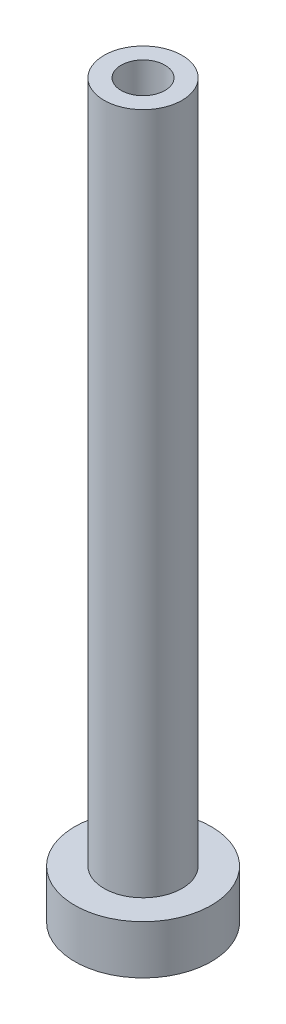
ISO-10303-21;
HEADER;
FILE_DESCRIPTION(('STEP AP214'),'2;1');
FILE_NAME('part.step','',(''),(''),'','','');
FILE_SCHEMA(('AUTOMOTIVE_DESIGN { 1 0 10303 214 1 1 1 1 }'));
ENDSEC;
DATA;
#1=APPLICATION_CONTEXT('core data for automotive mechanical design processes');
#2=APPLICATION_PROTOCOL_DEFINITION('international standard','automotive_design',2000,#1);
#3=PRODUCT_CONTEXT('',#1,'mechanical');
#4=PRODUCT('Part','Part','',(#3));
#5=PRODUCT_RELATED_PRODUCT_CATEGORY('part','',(#4));
#6=PRODUCT_DEFINITION_FORMATION('','',#4);
#7=PRODUCT_DEFINITION_CONTEXT('part definition',#1,'design');
#8=PRODUCT_DEFINITION('design','',#6,#7);
#9=PRODUCT_DEFINITION_SHAPE('','',#8);
#10=(LENGTH_UNIT() NAMED_UNIT(*) SI_UNIT(.MILLI.,.METRE.));
#11=(NAMED_UNIT(*) PLANE_ANGLE_UNIT() SI_UNIT($,.RADIAN.));
#12=(NAMED_UNIT(*) SI_UNIT($,.STERADIAN.) SOLID_ANGLE_UNIT());
#13=UNCERTAINTY_MEASURE_WITH_UNIT(LENGTH_MEASURE(1.E-05),#10,'distance_accuracy_value','');
#14=(GEOMETRIC_REPRESENTATION_CONTEXT(3) GLOBAL_UNCERTAINTY_ASSIGNED_CONTEXT((#13)) GLOBAL_UNIT_ASSIGNED_CONTEXT((#10,
#11,#12)) REPRESENTATION_CONTEXT('',''));
#15=CARTESIAN_POINT('',(0.,0.,0.));
#16=DIRECTION('',(0.,0.,1.));
#17=DIRECTION('',(1.,0.,0.));
#18=AXIS2_PLACEMENT_3D('',#15,#16,#17);
#19=CARTESIAN_POINT('',(0.,0.,0.));
#20=DIRECTION('',(0.,-1.,0.));
#21=DIRECTION('',(0.,0.,-1.));
#22=AXIS2_PLACEMENT_3D('',#19,#20,#21);
#23=CYLINDRICAL_SURFACE('',#22,7.);
#24=CARTESIAN_POINT('',(0.,-5.,0.));
#25=DIRECTION('',(0.,-1.,0.));
#26=DIRECTION('',(0.,0.,-1.));
#27=AXIS2_PLACEMENT_3D('',#24,#25,#26);
#28=CIRCLE('',#27,7.);
#29=CARTESIAN_POINT('',(0.,-5.,-7.));
#30=VERTEX_POINT('',#29);
#31=EDGE_CURVE('E41',#30,#30,#28,.T.);
#32=ORIENTED_EDGE('',*,*,#31,.F.);
#33=EDGE_LOOP('',(#32));
#34=FACE_BOUND('',#33,.T.);
#35=CARTESIAN_POINT('',(0.,0.,0.));
#36=DIRECTION('',(0.,-1.,0.));
#37=DIRECTION('',(0.,0.,-1.));
#38=AXIS2_PLACEMENT_3D('',#35,#36,#37);
#39=CIRCLE('',#38,7.);
#40=CARTESIAN_POINT('',(0.,0.,-7.));
#41=VERTEX_POINT('',#40);
#42=EDGE_CURVE('E8',#41,#41,#39,.T.);
#43=ORIENTED_EDGE('',*,*,#42,.T.);
#44=EDGE_LOOP('',(#43));
#45=FACE_BOUND('',#44,.T.);
#46=ADVANCED_FACE('F13',(#34,#45),#23,.T.);
#47=CARTESIAN_POINT('',(-7.,0.,0.));
#48=DIRECTION('',(0.,-1.,0.));
#49=DIRECTION('',(0.,0.,-1.));
#50=AXIS2_PLACEMENT_3D('',#47,#48,#49);
#51=PLANE('',#50);
#52=ORIENTED_EDGE('',*,*,#42,.F.);
#53=EDGE_LOOP('',(#52));
#54=FACE_BOUND('',#53,.T.);
#55=CARTESIAN_POINT('',(0.,0.,0.));
#56=DIRECTION('',(0.,-1.,0.));
#57=DIRECTION('',(0.,0.,-1.));
#58=AXIS2_PLACEMENT_3D('',#55,#56,#57);
#59=CIRCLE('',#58,4.);
#60=CARTESIAN_POINT('',(0.,0.,-4.));
#61=VERTEX_POINT('',#60);
#62=EDGE_CURVE('E19',#61,#61,#59,.T.);
#63=ORIENTED_EDGE('',*,*,#62,.T.);
#64=EDGE_LOOP('',(#63));
#65=FACE_BOUND('',#64,.T.);
#66=ADVANCED_FACE('F48',(#54,#65),#51,.F.);
#67=CARTESIAN_POINT('',(0.,0.,0.));
#68=DIRECTION('',(0.,-1.,0.));
#69=DIRECTION('',(0.,0.,-1.));
#70=AXIS2_PLACEMENT_3D('',#67,#68,#69);
#71=CYLINDRICAL_SURFACE('',#70,4.);
#72=ORIENTED_EDGE('',*,*,#62,.F.);
#73=EDGE_LOOP('',(#72));
#74=FACE_BOUND('',#73,.T.);
#75=CARTESIAN_POINT('',(0.,70.,0.));
#76=DIRECTION('',(0.,-1.,0.));
#77=DIRECTION('',(0.,0.,-1.));
#78=AXIS2_PLACEMENT_3D('',#75,#76,#77);
#79=CIRCLE('',#78,4.);
#80=CARTESIAN_POINT('',(0.,70.,-4.));
#81=VERTEX_POINT('',#80);
#82=EDGE_CURVE('E23',#81,#81,#79,.T.);
#83=ORIENTED_EDGE('',*,*,#82,.T.);
#84=EDGE_LOOP('',(#83));
#85=FACE_BOUND('',#84,.T.);
#86=ADVANCED_FACE('F54',(#74,#85),#71,.T.);
#87=CARTESIAN_POINT('',(-4.,70.,0.));
#88=DIRECTION('',(0.,-1.,0.));
#89=DIRECTION('',(0.,0.,-1.));
#90=AXIS2_PLACEMENT_3D('',#87,#88,#89);
#91=PLANE('',#90);
#92=ORIENTED_EDGE('',*,*,#82,.F.);
#93=EDGE_LOOP('',(#92));
#94=FACE_BOUND('',#93,.T.);
#95=CARTESIAN_POINT('',(0.,70.,0.));
#96=DIRECTION('',(0.,-1.,0.));
#97=DIRECTION('',(0.,0.,-1.));
#98=AXIS2_PLACEMENT_3D('',#95,#96,#97);
#99=CIRCLE('',#98,2.24999999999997);
#100=CARTESIAN_POINT('',(0.,70.,-2.24999999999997));
#101=VERTEX_POINT('',#100);
#102=EDGE_CURVE('E27',#101,#101,#99,.T.);
#103=ORIENTED_EDGE('',*,*,#102,.T.);
#104=EDGE_LOOP('',(#103));
#105=FACE_BOUND('',#104,.T.);
#106=ADVANCED_FACE('F60',(#94,#105),#91,.F.);
#107=CARTESIAN_POINT('',(0.,0.,0.));
#108=DIRECTION('',(0.,-1.,0.));
#109=DIRECTION('',(0.,0.,-1.));
#110=AXIS2_PLACEMENT_3D('',#107,#108,#109);
#111=CYLINDRICAL_SURFACE('',#110,2.24999999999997);
#112=ORIENTED_EDGE('',*,*,#102,.F.);
#113=EDGE_LOOP('',(#112));
#114=FACE_BOUND('',#113,.T.);
#115=CARTESIAN_POINT('',(0.,25.,0.));
#116=DIRECTION('',(0.,-1.,0.));
#117=DIRECTION('',(0.,0.,-1.));
#118=AXIS2_PLACEMENT_3D('',#115,#116,#117);
#119=CIRCLE('',#118,2.24999999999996);
#120=CARTESIAN_POINT('',(0.,25.,-2.24999999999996));
#121=VERTEX_POINT('',#120);
#122=EDGE_CURVE('E32',#121,#121,#119,.T.);
#123=ORIENTED_EDGE('',*,*,#122,.T.);
#124=EDGE_LOOP('',(#123));
#125=FACE_BOUND('',#124,.T.);
#126=ADVANCED_FACE('F66',(#114,#125),#111,.F.);
#127=CARTESIAN_POINT('',(0.,24.6,0.));
#128=DIRECTION('',(0.,-1.,0.));
#129=DIRECTION('',(0.,0.,-1.));
#130=AXIS2_PLACEMENT_3D('',#127,#128,#129);
#131=CONICAL_SURFACE('',#130,2.65,0.785398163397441);
#132=ORIENTED_EDGE('',*,*,#122,.F.);
#133=EDGE_LOOP('',(#132));
#134=FACE_BOUND('',#133,.T.);
#135=CARTESIAN_POINT('',(0.,24.6,0.));
#136=DIRECTION('',(0.,-1.,0.));
#137=DIRECTION('',(0.,0.,-1.));
#138=AXIS2_PLACEMENT_3D('',#135,#136,#137);
#139=CIRCLE('',#138,2.65);
#140=CARTESIAN_POINT('',(0.,24.6,-2.65));
#141=VERTEX_POINT('',#140);
#142=EDGE_CURVE('E35',#141,#141,#139,.T.);
#143=ORIENTED_EDGE('',*,*,#142,.T.);
#144=EDGE_LOOP('',(#143));
#145=FACE_BOUND('',#144,.T.);
#146=ADVANCED_FACE('F70',(#134,#145),#131,.F.);
#147=CARTESIAN_POINT('',(0.,0.,0.));
#148=DIRECTION('',(0.,-1.,0.));
#149=DIRECTION('',(0.,0.,-1.));
#150=AXIS2_PLACEMENT_3D('',#147,#148,#149);
#151=CYLINDRICAL_SURFACE('',#150,2.65);
#152=ORIENTED_EDGE('',*,*,#142,.F.);
#153=EDGE_LOOP('',(#152));
#154=FACE_BOUND('',#153,.T.);
#155=CARTESIAN_POINT('',(0.,-5.,0.));
#156=DIRECTION('',(0.,-1.,0.));
#157=DIRECTION('',(0.,0.,-1.));
#158=AXIS2_PLACEMENT_3D('',#155,#156,#157);
#159=CIRCLE('',#158,2.65);
#160=CARTESIAN_POINT('',(0.,-5.,-2.65));
#161=VERTEX_POINT('',#160);
#162=EDGE_CURVE('E38',#161,#161,#159,.T.);
#163=ORIENTED_EDGE('',*,*,#162,.T.);
#164=EDGE_LOOP('',(#163));
#165=FACE_BOUND('',#164,.T.);
#166=ADVANCED_FACE('F74',(#154,#165),#151,.F.);
#167=CARTESIAN_POINT('',(-2.65,-5.,0.));
#168=DIRECTION('',(0.,1.,0.));
#169=DIRECTION('',(0.,0.,1.));
#170=AXIS2_PLACEMENT_3D('',#167,#168,#169);
#171=PLANE('',#170);
#172=ORIENTED_EDGE('',*,*,#162,.F.);
#173=EDGE_LOOP('',(#172));
#174=FACE_BOUND('',#173,.T.);
#175=ORIENTED_EDGE('',*,*,#31,.T.);
#176=EDGE_LOOP('',(#175));
#177=FACE_BOUND('',#176,.T.);
#178=ADVANCED_FACE('F45',(#174,#177),#171,.F.);
#179=CLOSED_SHELL('',(#46,#66,#86,#106,#126,#146,#166,#178));
#180=MANIFOLD_SOLID_BREP('B1',#179);
#181=ADVANCED_BREP_SHAPE_REPRESENTATION('',(#18,#180),#14);
#182=SHAPE_DEFINITION_REPRESENTATION(#9,#181);
ENDSEC;
END-ISO-10303-21;
